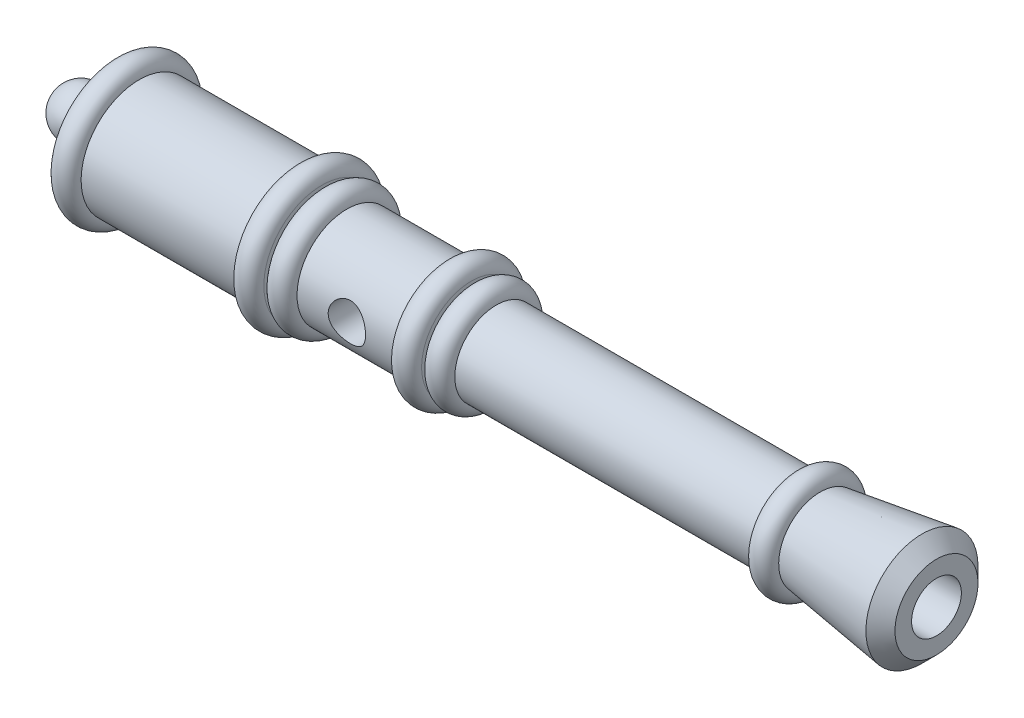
from build123d import *

# Parameters (mm, degrees)
CHAMFER1_SIZE      = 2
CHAMFER1_SIZE2     = 1.767766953
SKETCH3_R          = 2.25
CUT_EXTRUDE1_DEPTH = 10


with BuildPart() as part:
    # Sketch1 → Revolve1 (revolve)
    with BuildSketch(Plane.XY, mode=Mode.PRIVATE) as revolve1_sk:
        with BuildLine():
            Line((0, 0), (96.267949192, 0))
            Line((96.267949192, 0), (98, 3))
            Line((98, 3), (106, 3))
            Line((106, 3), (106, 7))
            Line((106, 7), (92, 5))
            ThreePointArc((92, 5), (90.5, 6.5), (89, 5))
            Line((89, 5), (53, 5))
            ThreePointArc((53, 5), (51.5, 6.5), (50, 5))
            Line((50, 5), (50, 6))
            ThreePointArc((50, 6), (48.5, 7.5), (47, 6))
            Line((47, 6), (35, 6))
            ThreePointArc((35, 6), (33.5, 7.5), (32, 6))
            Line((32, 6), (32, 7))
            ThreePointArc((32, 7), (30.5, 8.5), (29, 7))
            Line((29, 7), (10, 7))
            ThreePointArc((10, 7), (8.5, 8.5), (7, 7))
            ThreePointArc((7, 7), (6.255841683, 4.370647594), (4, 2.828427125))
            ThreePointArc((4, 2.828427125), (1.267949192, 2.449489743), (0, 0))
        make_face()
    revolve(revolve1_sk.sketch.rotate(Axis((0, 0, 0), (1, 0, 0)), 180), axis=Axis((0, 0, 0), (1, 0, 0)))

    # Chamfer1
    chamfer1_edges = [part.edges().sort_by_distance(p)[0] for p in [
        (106, 7, 0),
    ]]
    chamfer1_side = [part.faces().sort_by_distance(p)[0] for p in [
        (106, 3.197989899, 0),
    ]]
    chamfer(chamfer1_edges, length=CHAMFER1_SIZE, length2=CHAMFER1_SIZE2, reference=chamfer1_side[0])

    # Sketch3 → Cut-Extrude1 (cut, symmetric)
    with BuildSketch(Plane.XY):
        with Locations((41, 0)):
            Circle(SKETCH3_R)
    extrude(amount=CUT_EXTRUDE1_DEPTH, both=True, mode=Mode.SUBTRACT)


solid = part.part
